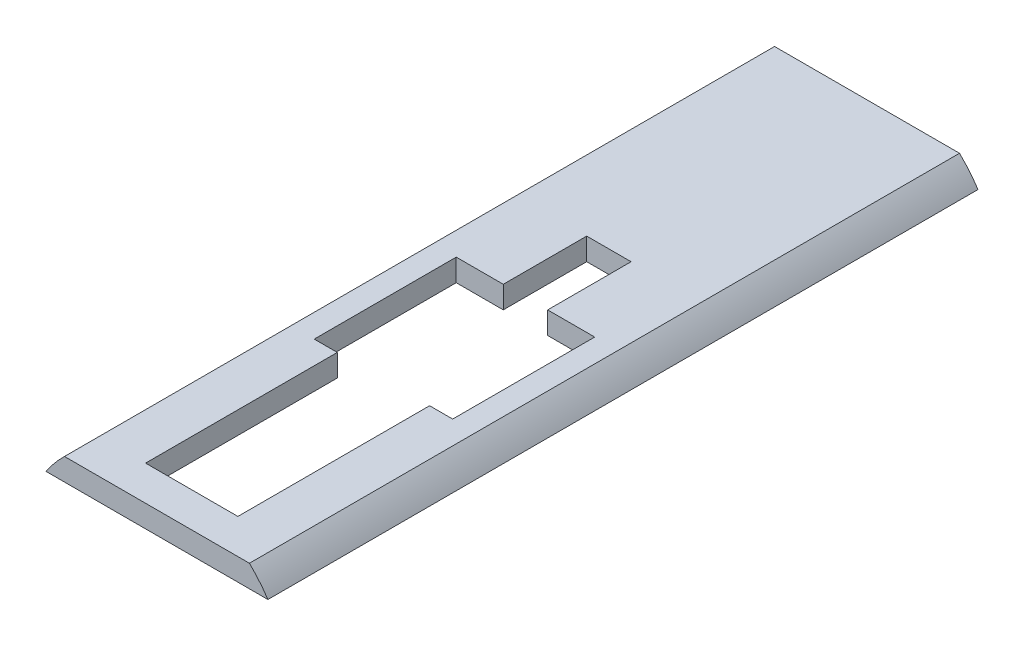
from build123d import *

# Parameters (mm, degrees)
SKETCH1_R          = 19.05
EXTRUDE1_DEPTH     = 101.6
CUT_EXTRUDE1_DEPTH = 106.111203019
CUT_EXTRUDE2_DEPTH = 103.881758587


with BuildPart() as part:
    # Sketch1 → Extrude1 (new body)
    with BuildSketch(Plane.XY):
        Circle(SKETCH1_R)
    extrude(amount=EXTRUDE1_DEPTH)

    # Sketch2 → Cut-Extrude1 (cut, through all)
    with BuildSketch(Plane.XY.offset(101.6)):
        with BuildLine():
            Line((-13.231315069, 13.705283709), (13.231315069, 13.705283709))
            ThreePointArc((13.231315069, 13.705283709), (0, 19.05), (-13.231315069, 13.705283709))
        make_face()
        with BuildLine():
            Line((-15.875, 10.530283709), (15.875, 10.530283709))
            ThreePointArc((15.875, 10.530283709), (0, -19.05), (-15.875, 10.530283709))
        make_face()
    extrude(amount=-CUT_EXTRUDE1_DEPTH, mode=Mode.SUBTRACT)

    # Sketch3 → Cut-Extrude2 (cut, through all)
    with BuildSketch(Plane(origin=(0, 13.705283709, 0), x_dir=(-1, 0, 0), z_dir=(0, 1, 0))):
        Polygon((6.604, 96.62514126), (-6.604, 96.62514126), (-6.604, 69.19314126), (-9.906, 69.19314126), (-9.906, 48.87314126), (-3.175, 48.87314126), (-3.175, 36.93514126), (3.175, 36.93514126), (3.175, 48.87314126), (9.906, 48.87314126), (9.906, 69.19314126), (6.604, 69.19314126), align=None)
    extrude(amount=-CUT_EXTRUDE2_DEPTH, mode=Mode.SUBTRACT)


solid = part.part
